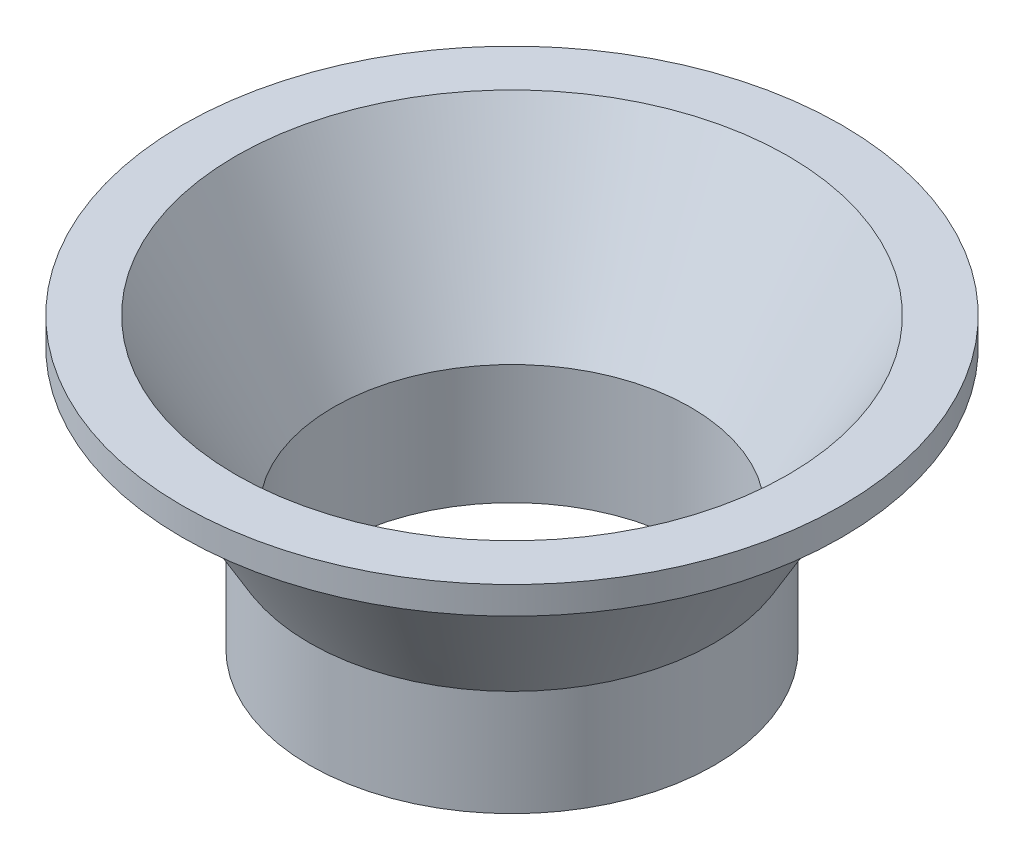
from build123d import *

# Parameters (mm, degrees)
ESQUISSE2_R      = 0.497993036
EXTRUSION1_DEPTH = 2.85


with BuildPart() as part:
    # Esquisse1 → R_volution1 (revolve)
    with BuildSketch(Plane.XY, mode=Mode.PRIVATE) as r_volution1_sk:
        Polygon((6.5, 1.854162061), (10.048301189, 8), (12, 8), (12, 7), (10.625651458, 7), (7.366025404, 1.354162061), (7.366025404, -2.5), (6.5, -2.5), align=None)
    revolve(r_volution1_sk.sketch.rotate(Axis((0, 0, 0), (0, 1, 0)), 90), axis=Axis((0, 0, 0), (0, 1, 0)))

    # Esquisse2 → Extrusion1 (add)
    with BuildSketch(Plane.XZ.offset(2.5)):
        with Locations((0, 6.499457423)):
            Circle(ESQUISSE2_R)
    extrude(amount=-EXTRUSION1_DEPTH)


solid = part.part
